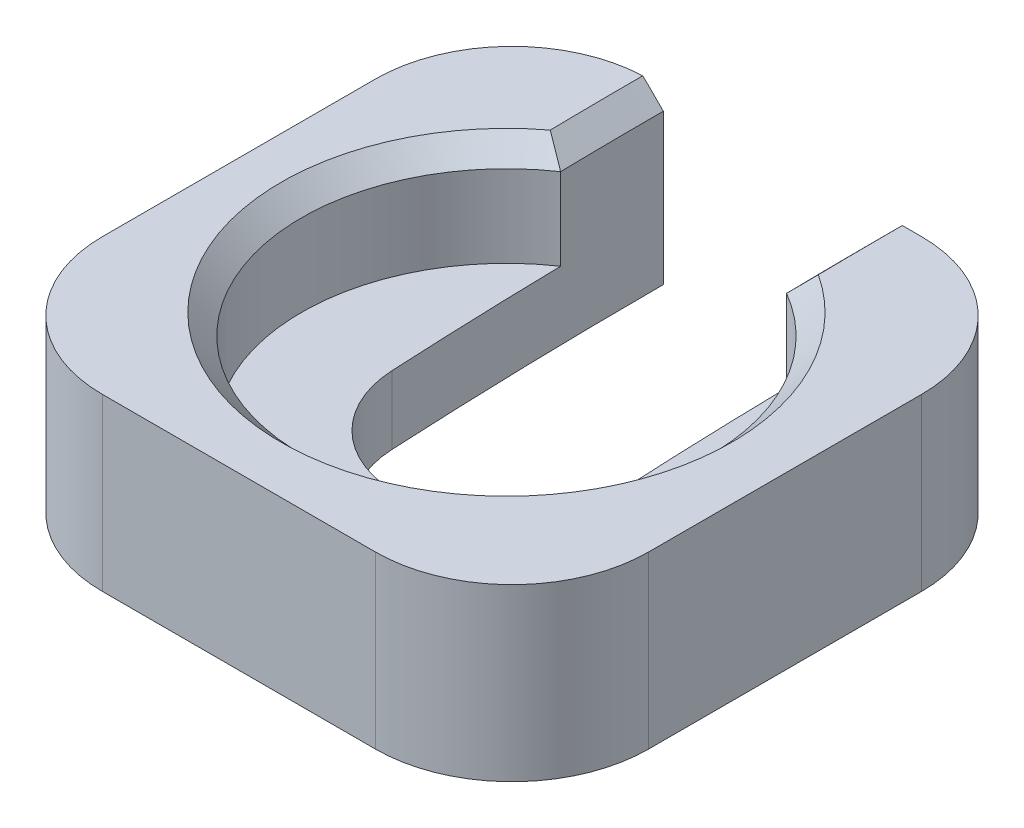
from build123d import *

# Parameters (mm, degrees)
RESSALTO_EXTRUS_O1_DEPTH = 2.5
ESBO_O2_R                = 3
CORTE_EXTRUS_O1_DEPTH    = 1.5
CHANFRO1_SIZE            = 0.3
FILETE1_R                = 2


with BuildPart() as part:
    # Esbo_o1 → Ressalto-extrus_o1 (new body)
    with BuildSketch(Plane(origin=(0, 0, 0), x_dir=(1, 0, 0), z_dir=(0, 1, 0))):
        with BuildLine():
            Line((1.416727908, 0), (4, 0))
            Line((4, 0), (4, -8))
            Line((4, -8), (-4, -8))
            Line((-4, -8), (-4, 0))
            Line((-4, 0), (-1.783272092, 0))
            ThreePointArc((-1.783272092, 0), (-1.757287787, -2.041373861), (-1.679351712, -4.081424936))
            ThreePointArc((-1.679351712, -4.081424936), (0, -5.597926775), (1.516501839, -3.918575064))
            ThreePointArc((1.516501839, -3.918575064), (1.441675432, -1.959922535), (1.416727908, 0))
        make_face()
    extrude(amount=RESSALTO_EXTRUS_O1_DEPTH)

    # Esbo_o2 → Corte-extrus_o1 (cut)
    with BuildSketch(Plane(origin=(0, 2.5, 0), x_dir=(1, 0, 0), z_dir=(0, 1, 0))):
        with Locations((-0.081424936, -4)):
            Circle(ESBO_O2_R)
    extrude(amount=-CORTE_EXTRUS_O1_DEPTH, mode=Mode.SUBTRACT)

    # Chanfro1
    chanfro1_edges = [part.edges().sort_by_distance(p)[0] for p in [
        (-1.779672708, 2.5, 0.759821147),
        (0.022857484, 2.5, 6.998186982),
        (1.419948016, 2.5, 0.704191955),
    ]]
    chamfer(chanfro1_edges, length=CHANFRO1_SIZE)

    # Filete1
    filete1_edges = [part.edges().sort_by_distance(p)[0] for p in [
        (4, 1.25, 0),
        (4, 1.25, 8),
        (-4, 1.25, 8),
        (-4, 1.25, 0),
    ]]
    fillet(filete1_edges, radius=FILETE1_R)


solid = part.part
